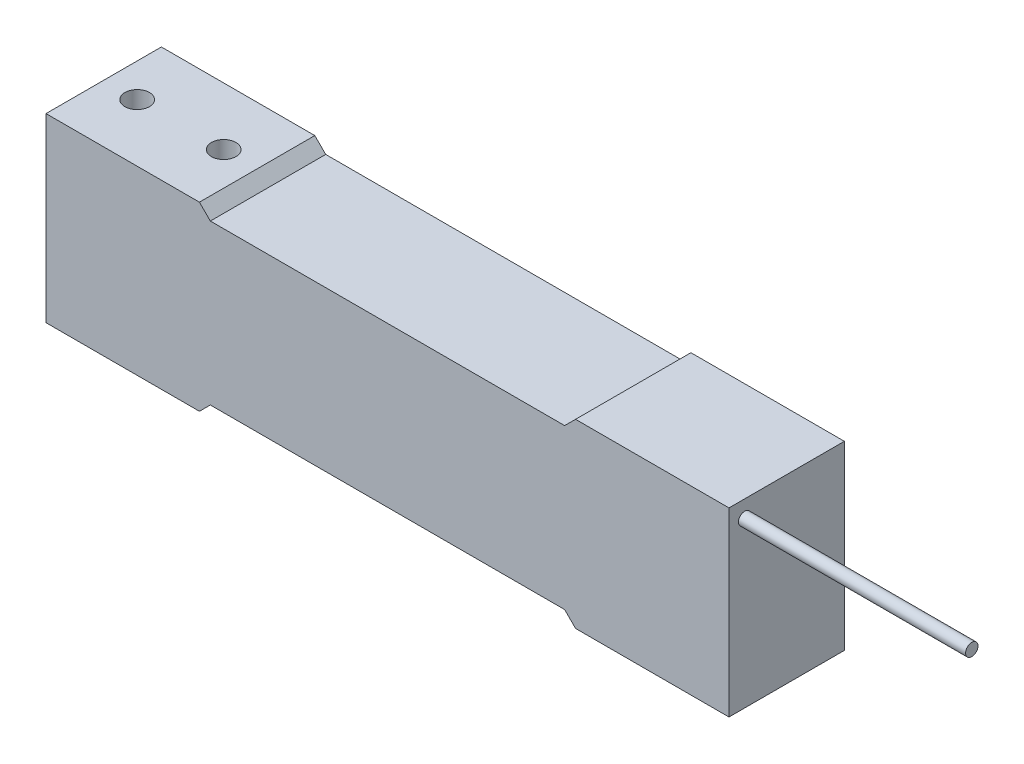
ISO-10303-21;
HEADER;
FILE_DESCRIPTION(('STEP AP214'),'2;1');
FILE_NAME('part.step','',(''),(''),'','','');
FILE_SCHEMA(('AUTOMOTIVE_DESIGN { 1 0 10303 214 1 1 1 1 }'));
ENDSEC;
DATA;
#1=APPLICATION_CONTEXT('core data for automotive mechanical design processes');
#2=APPLICATION_PROTOCOL_DEFINITION('international standard','automotive_design',2000,#1);
#3=PRODUCT_CONTEXT('',#1,'mechanical');
#4=PRODUCT('Part','Part','',(#3));
#5=PRODUCT_RELATED_PRODUCT_CATEGORY('part','',(#4));
#6=PRODUCT_DEFINITION_FORMATION('','',#4);
#7=PRODUCT_DEFINITION_CONTEXT('part definition',#1,'design');
#8=PRODUCT_DEFINITION('design','',#6,#7);
#9=PRODUCT_DEFINITION_SHAPE('','',#8);
#10=(LENGTH_UNIT() NAMED_UNIT(*) SI_UNIT(.MILLI.,.METRE.));
#11=(NAMED_UNIT(*) PLANE_ANGLE_UNIT() SI_UNIT($,.RADIAN.));
#12=(NAMED_UNIT(*) SI_UNIT($,.STERADIAN.) SOLID_ANGLE_UNIT());
#13=UNCERTAINTY_MEASURE_WITH_UNIT(LENGTH_MEASURE(1.E-05),#10,'distance_accuracy_value','');
#14=(GEOMETRIC_REPRESENTATION_CONTEXT(3) GLOBAL_UNCERTAINTY_ASSIGNED_CONTEXT((#13)) GLOBAL_UNIT_ASSIGNED_CONTEXT((#10,
#11,#12)) REPRESENTATION_CONTEXT('',''));
#15=CARTESIAN_POINT('',(0.,0.,0.));
#16=DIRECTION('',(0.,0.,1.));
#17=DIRECTION('',(1.,0.,0.));
#18=AXIS2_PLACEMENT_3D('',#15,#16,#17);
#19=CARTESIAN_POINT('',(75.184,19.939,-12.7));
#20=DIRECTION('',(-1.,0.,0.));
#21=DIRECTION('',(0.,0.,1.));
#22=AXIS2_PLACEMENT_3D('',#19,#20,#21);
#23=PLANE('',#22);
#24=DIRECTION('',(0.,0.,-1.));
#25=VECTOR('',#24,1.);
#26=CARTESIAN_POINT('',(75.184,-19.939,-12.7));
#27=LINE('',#26,#25);
#28=CARTESIAN_POINT('',(75.184,-19.939,12.7));
#29=VERTEX_POINT('',#28);
#30=CARTESIAN_POINT('',(75.184,-19.939,-12.7));
#31=VERTEX_POINT('',#30);
#32=EDGE_CURVE('E237',#29,#31,#27,.T.);
#33=ORIENTED_EDGE('',*,*,#32,.T.);
#34=DIRECTION('',(0.,-1.,0.));
#35=VECTOR('',#34,1.);
#36=CARTESIAN_POINT('',(75.184,19.939,-12.7));
#37=LINE('',#36,#35);
#38=CARTESIAN_POINT('',(75.184,19.939,-12.7));
#39=VERTEX_POINT('',#38);
#40=EDGE_CURVE('E41',#39,#31,#37,.T.);
#41=ORIENTED_EDGE('',*,*,#40,.F.);
#42=DIRECTION('',(0.,0.,-1.));
#43=VECTOR('',#42,1.);
#44=CARTESIAN_POINT('',(75.184,19.939,-12.7));
#45=LINE('',#44,#43);
#46=CARTESIAN_POINT('',(75.184,19.939,12.7));
#47=VERTEX_POINT('',#46);
#48=EDGE_CURVE('E246',#47,#39,#45,.T.);
#49=ORIENTED_EDGE('',*,*,#48,.F.);
#50=DIRECTION('',(0.,-1.,0.));
#51=VECTOR('',#50,1.);
#52=CARTESIAN_POINT('',(75.184,19.939,12.7));
#53=LINE('',#52,#51);
#54=EDGE_CURVE('E264',#47,#29,#53,.T.);
#55=ORIENTED_EDGE('',*,*,#54,.T.);
#56=EDGE_LOOP('',(#33,#41,#49,#55));
#57=FACE_BOUND('',#56,.T.);
#58=CARTESIAN_POINT('',(75.184,16.2079247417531,9.24452003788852));
#59=DIRECTION('',(-1.,0.,0.));
#60=DIRECTION('',(0.,0.,1.));
#61=AXIS2_PLACEMENT_3D('',#58,#59,#60);
#62=CIRCLE('',#61,1.36770933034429);
#63=CARTESIAN_POINT('',(75.184,16.2079247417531,10.6122293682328));
#64=VERTEX_POINT('',#63);
#65=EDGE_CURVE('E11',#64,#64,#62,.F.);
#66=ORIENTED_EDGE('',*,*,#65,.F.);
#67=EDGE_LOOP('',(#66));
#68=FACE_BOUND('',#67,.T.);
#69=ADVANCED_FACE('F33',(#57,#68),#23,.F.);
#70=CARTESIAN_POINT('',(-75.184,19.939,-12.7));
#71=DIRECTION('',(0.,0.,1.));
#72=DIRECTION('',(1.,0.,0.));
#73=AXIS2_PLACEMENT_3D('',#70,#71,#72);
#74=PLANE('',#73);
#75=DIRECTION('',(0.707106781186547,0.707106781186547,0.));
#76=VECTOR('',#75,1.);
#77=CARTESIAN_POINT('',(-41.402,-19.939,-12.7));
#78=LINE('',#77,#76);
#79=CARTESIAN_POINT('',(-41.402,-19.939,-12.7));
#80=VERTEX_POINT('',#79);
#81=CARTESIAN_POINT('',(-39.002,-17.539,-12.7));
#82=VERTEX_POINT('',#81);
#83=EDGE_CURVE('E163',#80,#82,#78,.T.);
#84=ORIENTED_EDGE('',*,*,#83,.F.);
#85=DIRECTION('',(-1.,0.,0.));
#86=VECTOR('',#85,1.);
#87=CARTESIAN_POINT('',(-75.184,-19.939,-12.7));
#88=LINE('',#87,#86);
#89=CARTESIAN_POINT('',(-75.184,-19.939,-12.7));
#90=VERTEX_POINT('',#89);
#91=EDGE_CURVE('E268',#80,#90,#88,.T.);
#92=ORIENTED_EDGE('',*,*,#91,.T.);
#93=DIRECTION('',(0.,-1.,0.));
#94=VECTOR('',#93,1.);
#95=CARTESIAN_POINT('',(-75.184,19.939,-12.7));
#96=LINE('',#95,#94);
#97=CARTESIAN_POINT('',(-75.184,19.939,-12.7));
#98=VERTEX_POINT('',#97);
#99=EDGE_CURVE('E287',#98,#90,#96,.T.);
#100=ORIENTED_EDGE('',*,*,#99,.F.);
#101=DIRECTION('',(-1.,0.,0.));
#102=VECTOR('',#101,1.);
#103=CARTESIAN_POINT('',(-75.184,19.939,-12.7));
#104=LINE('',#103,#102);
#105=CARTESIAN_POINT('',(-41.402,19.939,-12.7));
#106=VERTEX_POINT('',#105);
#107=EDGE_CURVE('E250',#106,#98,#104,.T.);
#108=ORIENTED_EDGE('',*,*,#107,.F.);
#109=DIRECTION('',(0.707106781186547,-0.707106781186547,0.));
#110=VECTOR('',#109,1.);
#111=CARTESIAN_POINT('',(-41.402,19.939,-12.7));
#112=LINE('',#111,#110);
#113=CARTESIAN_POINT('',(-39.002,17.539,-12.7));
#114=VERTEX_POINT('',#113);
#115=EDGE_CURVE('E212',#106,#114,#112,.T.);
#116=ORIENTED_EDGE('',*,*,#115,.T.);
#117=DIRECTION('',(1.,0.,0.));
#118=VECTOR('',#117,1.);
#119=CARTESIAN_POINT('',(-39.002,17.539,-12.7));
#120=LINE('',#119,#118);
#121=CARTESIAN_POINT('',(39.002,17.539,-12.7));
#122=VERTEX_POINT('',#121);
#123=EDGE_CURVE('E216',#114,#122,#120,.T.);
#124=ORIENTED_EDGE('',*,*,#123,.T.);
#125=DIRECTION('',(0.707106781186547,0.707106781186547,0.));
#126=VECTOR('',#125,1.);
#127=CARTESIAN_POINT('',(41.402,19.939,-12.7));
#128=LINE('',#127,#126);
#129=CARTESIAN_POINT('',(41.402,19.939,-12.7));
#130=VERTEX_POINT('',#129);
#131=EDGE_CURVE('E220',#122,#130,#128,.T.);
#132=ORIENTED_EDGE('',*,*,#131,.T.);
#133=EDGE_CURVE('E252',#39,#130,#104,.T.);
#134=ORIENTED_EDGE('',*,*,#133,.F.);
#135=ORIENTED_EDGE('',*,*,#40,.T.);
#136=CARTESIAN_POINT('',(41.402,-19.939,-12.7));
#137=VERTEX_POINT('',#136);
#138=EDGE_CURVE('E269',#31,#137,#88,.T.);
#139=ORIENTED_EDGE('',*,*,#138,.T.);
#140=DIRECTION('',(0.707106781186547,-0.707106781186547,0.));
#141=VECTOR('',#140,1.);
#142=CARTESIAN_POINT('',(41.402,-19.939,-12.7));
#143=LINE('',#142,#141);
#144=CARTESIAN_POINT('',(39.002,-17.539,-12.7));
#145=VERTEX_POINT('',#144);
#146=EDGE_CURVE('E48',#145,#137,#143,.T.);
#147=ORIENTED_EDGE('',*,*,#146,.F.);
#148=DIRECTION('',(1.,0.,0.));
#149=VECTOR('',#148,1.);
#150=CARTESIAN_POINT('',(-39.002,-17.539,-12.7));
#151=LINE('',#150,#149);
#152=EDGE_CURVE('E169',#82,#145,#151,.T.);
#153=ORIENTED_EDGE('',*,*,#152,.F.);
#154=EDGE_LOOP('',(#84,#92,#100,#108,#116,#124,#132,#134,#135,#139,#147,#153));
#155=FACE_BOUND('',#154,.T.);
#156=ADVANCED_FACE('F294',(#155),#74,.F.);
#157=CARTESIAN_POINT('',(-75.184,19.939,12.7));
#158=DIRECTION('',(0.,0.,-1.));
#159=DIRECTION('',(-1.,0.,0.));
#160=AXIS2_PLACEMENT_3D('',#157,#158,#159);
#161=PLANE('',#160);
#162=DIRECTION('',(0.707106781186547,0.707106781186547,0.));
#163=VECTOR('',#162,1.);
#164=CARTESIAN_POINT('',(-41.402,-19.939,12.7));
#165=LINE('',#164,#163);
#166=CARTESIAN_POINT('',(-41.402,-19.939,12.7));
#167=VERTEX_POINT('',#166);
#168=CARTESIAN_POINT('',(-39.002,-17.539,12.7));
#169=VERTEX_POINT('',#168);
#170=EDGE_CURVE('E162',#167,#169,#165,.T.);
#171=ORIENTED_EDGE('',*,*,#170,.T.);
#172=DIRECTION('',(1.,0.,0.));
#173=VECTOR('',#172,1.);
#174=CARTESIAN_POINT('',(-39.002,-17.539,12.7));
#175=LINE('',#174,#173);
#176=CARTESIAN_POINT('',(39.002,-17.539,12.7));
#177=VERTEX_POINT('',#176);
#178=EDGE_CURVE('E166',#169,#177,#175,.T.);
#179=ORIENTED_EDGE('',*,*,#178,.T.);
#180=DIRECTION('',(0.707106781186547,-0.707106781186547,0.));
#181=VECTOR('',#180,1.);
#182=CARTESIAN_POINT('',(41.402,-19.939,12.7));
#183=LINE('',#182,#181);
#184=CARTESIAN_POINT('',(41.402,-19.939,12.7));
#185=VERTEX_POINT('',#184);
#186=EDGE_CURVE('E176',#177,#185,#183,.T.);
#187=ORIENTED_EDGE('',*,*,#186,.T.);
#188=DIRECTION('',(1.,0.,0.));
#189=VECTOR('',#188,1.);
#190=CARTESIAN_POINT('',(-75.184,-19.939,12.7));
#191=LINE('',#190,#189);
#192=EDGE_CURVE('E276',#185,#29,#191,.T.);
#193=ORIENTED_EDGE('',*,*,#192,.T.);
#194=ORIENTED_EDGE('',*,*,#54,.F.);
#195=DIRECTION('',(1.,0.,0.));
#196=VECTOR('',#195,1.);
#197=CARTESIAN_POINT('',(-75.184,19.939,12.7));
#198=LINE('',#197,#196);
#199=CARTESIAN_POINT('',(41.402,19.939,12.7));
#200=VERTEX_POINT('',#199);
#201=EDGE_CURVE('E259',#200,#47,#198,.T.);
#202=ORIENTED_EDGE('',*,*,#201,.F.);
#203=DIRECTION('',(0.707106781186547,0.707106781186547,0.));
#204=VECTOR('',#203,1.);
#205=CARTESIAN_POINT('',(41.402,19.939,12.7));
#206=LINE('',#205,#204);
#207=CARTESIAN_POINT('',(39.002,17.539,12.7));
#208=VERTEX_POINT('',#207);
#209=EDGE_CURVE('E56',#208,#200,#206,.T.);
#210=ORIENTED_EDGE('',*,*,#209,.F.);
#211=DIRECTION('',(1.,0.,0.));
#212=VECTOR('',#211,1.);
#213=CARTESIAN_POINT('',(-39.002,17.539,12.7));
#214=LINE('',#213,#212);
#215=CARTESIAN_POINT('',(-39.002,17.539,12.7));
#216=VERTEX_POINT('',#215);
#217=EDGE_CURVE('E228',#216,#208,#214,.T.);
#218=ORIENTED_EDGE('',*,*,#217,.F.);
#219=DIRECTION('',(0.707106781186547,-0.707106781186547,0.));
#220=VECTOR('',#219,1.);
#221=CARTESIAN_POINT('',(-41.402,19.939,12.7));
#222=LINE('',#221,#220);
#223=CARTESIAN_POINT('',(-41.402,19.939,12.7));
#224=VERTEX_POINT('',#223);
#225=EDGE_CURVE('E211',#224,#216,#222,.T.);
#226=ORIENTED_EDGE('',*,*,#225,.F.);
#227=CARTESIAN_POINT('',(-75.184,19.939,12.7));
#228=VERTEX_POINT('',#227);
#229=EDGE_CURVE('E260',#228,#224,#198,.T.);
#230=ORIENTED_EDGE('',*,*,#229,.F.);
#231=DIRECTION('',(0.,-1.,0.));
#232=VECTOR('',#231,1.);
#233=CARTESIAN_POINT('',(-75.184,19.939,12.7));
#234=LINE('',#233,#232);
#235=CARTESIAN_POINT('',(-75.184,-19.939,12.7));
#236=VERTEX_POINT('',#235);
#237=EDGE_CURVE('E283',#228,#236,#234,.T.);
#238=ORIENTED_EDGE('',*,*,#237,.T.);
#239=EDGE_CURVE('E251',#236,#167,#191,.T.);
#240=ORIENTED_EDGE('',*,*,#239,.T.);
#241=EDGE_LOOP('',(#171,#179,#187,#193,#194,#202,#210,#218,#226,#230,#238,#240));
#242=FACE_BOUND('',#241,.T.);
#243=ADVANCED_FACE('F306',(#242),#161,.F.);
#244=CARTESIAN_POINT('',(75.184,-19.939,12.7));
#245=DIRECTION('',(0.,1.,0.));
#246=DIRECTION('',(0.,0.,1.));
#247=AXIS2_PLACEMENT_3D('',#244,#245,#246);
#248=PLANE('',#247);
#249=DIRECTION('',(0.,0.,1.));
#250=VECTOR('',#249,1.);
#251=CARTESIAN_POINT('',(-41.402,-19.939,-12.7));
#252=LINE('',#251,#250);
#253=EDGE_CURVE('E172',#80,#167,#252,.T.);
#254=ORIENTED_EDGE('',*,*,#253,.T.);
#255=ORIENTED_EDGE('',*,*,#239,.F.);
#256=DIRECTION('',(0.,0.,1.));
#257=VECTOR('',#256,1.);
#258=CARTESIAN_POINT('',(-75.184,-19.939,-12.7));
#259=LINE('',#258,#257);
#260=EDGE_CURVE('E273',#90,#236,#259,.T.);
#261=ORIENTED_EDGE('',*,*,#260,.F.);
#262=ORIENTED_EDGE('',*,*,#91,.F.);
#263=EDGE_LOOP('',(#254,#255,#261,#262));
#264=FACE_BOUND('',#263,.T.);
#265=ADVANCED_FACE('F317',(#264),#248,.F.);
#266=CARTESIAN_POINT('',(67.8180000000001,-19.939,0.));
#267=DIRECTION('',(0.,-1.,0.));
#268=DIRECTION('',(0.,0.,-1.));
#269=AXIS2_PLACEMENT_3D('',#266,#267,#268);
#270=CIRCLE('',#269,2.70509999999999);
#271=CARTESIAN_POINT('',(67.8180000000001,-19.939,-2.70509999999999));
#272=VERTEX_POINT('',#271);
#273=EDGE_CURVE('E145',#272,#272,#270,.T.);
#274=ORIENTED_EDGE('',*,*,#273,.F.);
#275=EDGE_LOOP('',(#274));
#276=FACE_BOUND('',#275,.T.);
#277=CARTESIAN_POINT('',(48.768,-19.939,0.));
#278=DIRECTION('',(0.,-1.,0.));
#279=DIRECTION('',(0.,0.,-1.));
#280=AXIS2_PLACEMENT_3D('',#277,#278,#279);
#281=CIRCLE('',#280,2.70509999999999);
#282=CARTESIAN_POINT('',(48.768,-19.939,-2.70509999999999));
#283=VERTEX_POINT('',#282);
#284=EDGE_CURVE('E144',#283,#283,#281,.T.);
#285=ORIENTED_EDGE('',*,*,#284,.F.);
#286=EDGE_LOOP('',(#285));
#287=FACE_BOUND('',#286,.T.);
#288=DIRECTION('',(0.,0.,1.));
#289=VECTOR('',#288,1.);
#290=CARTESIAN_POINT('',(41.402,-19.939,-12.7));
#291=LINE('',#290,#289);
#292=EDGE_CURVE('E190',#137,#185,#291,.T.);
#293=ORIENTED_EDGE('',*,*,#292,.F.);
#294=ORIENTED_EDGE('',*,*,#138,.F.);
#295=ORIENTED_EDGE('',*,*,#32,.F.);
#296=ORIENTED_EDGE('',*,*,#192,.F.);
#297=EDGE_LOOP('',(#293,#294,#295,#296));
#298=FACE_BOUND('',#297,.T.);
#299=ADVANCED_FACE('F302',(#276,#287,#298),#248,.F.);
#300=CARTESIAN_POINT('',(75.184,19.939,12.7));
#301=DIRECTION('',(0.,1.,0.));
#302=DIRECTION('',(0.,0.,1.));
#303=AXIS2_PLACEMENT_3D('',#300,#301,#302);
#304=PLANE('',#303);
#305=CARTESIAN_POINT('',(-48.768,19.939,0.));
#306=DIRECTION('',(0.,1.,0.));
#307=DIRECTION('',(0.,0.,1.));
#308=AXIS2_PLACEMENT_3D('',#305,#306,#307);
#309=CIRCLE('',#308,2.70509999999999);
#310=CARTESIAN_POINT('',(-48.768,19.939,2.70509999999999));
#311=VERTEX_POINT('',#310);
#312=EDGE_CURVE('E186',#311,#311,#309,.T.);
#313=ORIENTED_EDGE('',*,*,#312,.F.);
#314=EDGE_LOOP('',(#313));
#315=FACE_BOUND('',#314,.T.);
#316=CARTESIAN_POINT('',(-67.818,19.939,0.));
#317=DIRECTION('',(0.,1.,0.));
#318=DIRECTION('',(0.,0.,1.));
#319=AXIS2_PLACEMENT_3D('',#316,#317,#318);
#320=CIRCLE('',#319,2.70509999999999);
#321=CARTESIAN_POINT('',(-67.818,19.939,2.70509999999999));
#322=VERTEX_POINT('',#321);
#323=EDGE_CURVE('E203',#322,#322,#320,.T.);
#324=ORIENTED_EDGE('',*,*,#323,.F.);
#325=EDGE_LOOP('',(#324));
#326=FACE_BOUND('',#325,.T.);
#327=DIRECTION('',(0.,0.,1.));
#328=VECTOR('',#327,1.);
#329=CARTESIAN_POINT('',(-41.402,19.939,-12.7));
#330=LINE('',#329,#328);
#331=EDGE_CURVE('E234',#106,#224,#330,.T.);
#332=ORIENTED_EDGE('',*,*,#331,.F.);
#333=ORIENTED_EDGE('',*,*,#107,.T.);
#334=DIRECTION('',(0.,0.,1.));
#335=VECTOR('',#334,1.);
#336=CARTESIAN_POINT('',(-75.184,19.939,-12.7));
#337=LINE('',#336,#335);
#338=EDGE_CURVE('E256',#98,#228,#337,.T.);
#339=ORIENTED_EDGE('',*,*,#338,.T.);
#340=ORIENTED_EDGE('',*,*,#229,.T.);
#341=EDGE_LOOP('',(#332,#333,#339,#340));
#342=FACE_BOUND('',#341,.T.);
#343=ADVANCED_FACE('F339',(#315,#326,#342),#304,.T.);
#344=CARTESIAN_POINT('',(-75.184,19.939,-12.7));
#345=DIRECTION('',(1.,0.,0.));
#346=DIRECTION('',(0.,0.,-1.));
#347=AXIS2_PLACEMENT_3D('',#344,#345,#346);
#348=PLANE('',#347);
#349=ORIENTED_EDGE('',*,*,#260,.T.);
#350=ORIENTED_EDGE('',*,*,#237,.F.);
#351=ORIENTED_EDGE('',*,*,#338,.F.);
#352=ORIENTED_EDGE('',*,*,#99,.T.);
#353=EDGE_LOOP('',(#349,#350,#351,#352));
#354=FACE_BOUND('',#353,.T.);
#355=ADVANCED_FACE('F344',(#354),#348,.F.);
#356=DIRECTION('',(0.,0.,1.));
#357=VECTOR('',#356,1.);
#358=CARTESIAN_POINT('',(41.402,19.939,-12.7));
#359=LINE('',#358,#357);
#360=EDGE_CURVE('E238',#130,#200,#359,.T.);
#361=ORIENTED_EDGE('',*,*,#360,.T.);
#362=ORIENTED_EDGE('',*,*,#201,.T.);
#363=ORIENTED_EDGE('',*,*,#48,.T.);
#364=ORIENTED_EDGE('',*,*,#133,.T.);
#365=EDGE_LOOP('',(#361,#362,#363,#364));
#366=FACE_BOUND('',#365,.T.);
#367=ADVANCED_FACE('F326',(#366),#304,.T.);
#368=CARTESIAN_POINT('',(-41.402,19.939,-12.7));
#369=DIRECTION('',(-0.707106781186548,-0.707106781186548,0.));
#370=DIRECTION('',(0.707106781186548,-0.707106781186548,0.));
#371=AXIS2_PLACEMENT_3D('',#368,#369,#370);
#372=PLANE('',#371);
#373=ORIENTED_EDGE('',*,*,#225,.T.);
#374=DIRECTION('',(0.,0.,1.));
#375=VECTOR('',#374,1.);
#376=CARTESIAN_POINT('',(-39.002,17.539,-12.7));
#377=LINE('',#376,#375);
#378=EDGE_CURVE('E224',#114,#216,#377,.T.);
#379=ORIENTED_EDGE('',*,*,#378,.F.);
#380=ORIENTED_EDGE('',*,*,#115,.F.);
#381=ORIENTED_EDGE('',*,*,#331,.T.);
#382=EDGE_LOOP('',(#373,#379,#380,#381));
#383=FACE_BOUND('',#382,.T.);
#384=ADVANCED_FACE('F335',(#383),#372,.F.);
#385=CARTESIAN_POINT('',(41.402,19.939,-12.7));
#386=DIRECTION('',(0.707106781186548,-0.707106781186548,0.));
#387=DIRECTION('',(0.707106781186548,0.707106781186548,0.));
#388=AXIS2_PLACEMENT_3D('',#385,#386,#387);
#389=PLANE('',#388);
#390=ORIENTED_EDGE('',*,*,#209,.T.);
#391=ORIENTED_EDGE('',*,*,#360,.F.);
#392=ORIENTED_EDGE('',*,*,#131,.F.);
#393=DIRECTION('',(0.,0.,1.));
#394=VECTOR('',#393,1.);
#395=CARTESIAN_POINT('',(39.002,17.539,-12.7));
#396=LINE('',#395,#394);
#397=EDGE_CURVE('E241',#122,#208,#396,.T.);
#398=ORIENTED_EDGE('',*,*,#397,.T.);
#399=EDGE_LOOP('',(#390,#391,#392,#398));
#400=FACE_BOUND('',#399,.T.);
#401=ADVANCED_FACE('F368',(#400),#389,.F.);
#402=CARTESIAN_POINT('',(-39.002,17.539,-12.7));
#403=DIRECTION('',(0.,-1.,0.));
#404=DIRECTION('',(0.,0.,-1.));
#405=AXIS2_PLACEMENT_3D('',#402,#403,#404);
#406=PLANE('',#405);
#407=ORIENTED_EDGE('',*,*,#217,.T.);
#408=ORIENTED_EDGE('',*,*,#397,.F.);
#409=ORIENTED_EDGE('',*,*,#123,.F.);
#410=ORIENTED_EDGE('',*,*,#378,.T.);
#411=EDGE_LOOP('',(#407,#408,#409,#410));
#412=FACE_BOUND('',#411,.T.);
#413=ADVANCED_FACE('F331',(#412),#406,.F.);
#414=CARTESIAN_POINT('',(-67.818,8.763,0.));
#415=DIRECTION('',(0.,1.,0.));
#416=DIRECTION('',(0.,0.,1.));
#417=AXIS2_PLACEMENT_3D('',#414,#415,#416);
#418=CONICAL_SURFACE('',#417,2.7051,1.02974425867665);
#419=CARTESIAN_POINT('',(-67.818,7.13761193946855,0.));
#420=VERTEX_POINT('',#419);
#421=VERTEX_LOOP('',#420);
#422=FACE_BOUND('',#421,.T.);
#423=CARTESIAN_POINT('',(-67.818,8.763,0.));
#424=DIRECTION('',(0.,1.,0.));
#425=DIRECTION('',(0.,0.,1.));
#426=AXIS2_PLACEMENT_3D('',#423,#424,#425);
#427=CIRCLE('',#426,2.7051);
#428=CARTESIAN_POINT('',(-67.818,8.763,2.7051));
#429=VERTEX_POINT('',#428);
#430=EDGE_CURVE('E207',#429,#429,#427,.T.);
#431=ORIENTED_EDGE('',*,*,#430,.T.);
#432=EDGE_LOOP('',(#431));
#433=FACE_BOUND('',#432,.T.);
#434=ADVANCED_FACE('F371',(#422,#433),#418,.F.);
#435=CARTESIAN_POINT('',(-67.818,19.939,0.));
#436=DIRECTION('',(0.,1.,0.));
#437=DIRECTION('',(0.,0.,1.));
#438=AXIS2_PLACEMENT_3D('',#435,#436,#437);
#439=CYLINDRICAL_SURFACE('',#438,2.70509999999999);
#440=ORIENTED_EDGE('',*,*,#430,.F.);
#441=EDGE_LOOP('',(#440));
#442=FACE_BOUND('',#441,.T.);
#443=ORIENTED_EDGE('',*,*,#323,.T.);
#444=EDGE_LOOP('',(#443));
#445=FACE_BOUND('',#444,.T.);
#446=ADVANCED_FACE('F376',(#442,#445),#439,.F.);
#447=CARTESIAN_POINT('',(-48.768,8.763,0.));
#448=DIRECTION('',(0.,1.,0.));
#449=DIRECTION('',(0.,0.,1.));
#450=AXIS2_PLACEMENT_3D('',#447,#448,#449);
#451=CONICAL_SURFACE('',#450,2.70509999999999,1.02974425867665);
#452=CARTESIAN_POINT('',(-48.768,7.13761193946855,0.));
#453=VERTEX_POINT('',#452);
#454=VERTEX_LOOP('',#453);
#455=FACE_BOUND('',#454,.T.);
#456=CARTESIAN_POINT('',(-48.768,8.763,0.));
#457=DIRECTION('',(0.,1.,0.));
#458=DIRECTION('',(0.,0.,1.));
#459=AXIS2_PLACEMENT_3D('',#456,#457,#458);
#460=CIRCLE('',#459,2.70509999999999);
#461=CARTESIAN_POINT('',(-48.768,8.763,2.70509999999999));
#462=VERTEX_POINT('',#461);
#463=EDGE_CURVE('E199',#462,#462,#460,.T.);
#464=ORIENTED_EDGE('',*,*,#463,.T.);
#465=EDGE_LOOP('',(#464));
#466=FACE_BOUND('',#465,.T.);
#467=ADVANCED_FACE('F380',(#455,#466),#451,.F.);
#468=CARTESIAN_POINT('',(-48.768,19.939,0.));
#469=DIRECTION('',(0.,1.,0.));
#470=DIRECTION('',(0.,0.,1.));
#471=AXIS2_PLACEMENT_3D('',#468,#469,#470);
#472=CYLINDRICAL_SURFACE('',#471,2.70509999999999);
#473=ORIENTED_EDGE('',*,*,#463,.F.);
#474=EDGE_LOOP('',(#473));
#475=FACE_BOUND('',#474,.T.);
#476=ORIENTED_EDGE('',*,*,#312,.T.);
#477=EDGE_LOOP('',(#476));
#478=FACE_BOUND('',#477,.T.);
#479=ADVANCED_FACE('F384',(#475,#478),#472,.F.);
#480=CARTESIAN_POINT('',(-41.402,-19.939,-12.7));
#481=DIRECTION('',(0.707106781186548,-0.707106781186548,0.));
#482=DIRECTION('',(0.707106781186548,0.707106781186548,0.));
#483=AXIS2_PLACEMENT_3D('',#480,#481,#482);
#484=PLANE('',#483);
#485=ORIENTED_EDGE('',*,*,#170,.F.);
#486=ORIENTED_EDGE('',*,*,#253,.F.);
#487=ORIENTED_EDGE('',*,*,#83,.T.);
#488=DIRECTION('',(0.,0.,1.));
#489=VECTOR('',#488,1.);
#490=CARTESIAN_POINT('',(-39.002,-17.539,-12.7));
#491=LINE('',#490,#489);
#492=EDGE_CURVE('E182',#82,#169,#491,.T.);
#493=ORIENTED_EDGE('',*,*,#492,.T.);
#494=EDGE_LOOP('',(#485,#486,#487,#493));
#495=FACE_BOUND('',#494,.T.);
#496=ADVANCED_FACE('F312',(#495),#484,.T.);
#497=CARTESIAN_POINT('',(-39.002,-17.539,-12.7));
#498=DIRECTION('',(0.,-1.,0.));
#499=DIRECTION('',(0.,0.,-1.));
#500=AXIS2_PLACEMENT_3D('',#497,#498,#499);
#501=PLANE('',#500);
#502=ORIENTED_EDGE('',*,*,#178,.F.);
#503=ORIENTED_EDGE('',*,*,#492,.F.);
#504=ORIENTED_EDGE('',*,*,#152,.T.);
#505=DIRECTION('',(0.,0.,1.));
#506=VECTOR('',#505,1.);
#507=CARTESIAN_POINT('',(39.002,-17.539,-12.7));
#508=LINE('',#507,#506);
#509=EDGE_CURVE('E187',#145,#177,#508,.T.);
#510=ORIENTED_EDGE('',*,*,#509,.T.);
#511=EDGE_LOOP('',(#502,#503,#504,#510));
#512=FACE_BOUND('',#511,.T.);
#513=ADVANCED_FACE('F309',(#512),#501,.T.);
#514=CARTESIAN_POINT('',(41.402,-19.939,-12.7));
#515=DIRECTION('',(-0.707106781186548,-0.707106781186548,0.));
#516=DIRECTION('',(0.707106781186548,-0.707106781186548,0.));
#517=AXIS2_PLACEMENT_3D('',#514,#515,#516);
#518=PLANE('',#517);
#519=ORIENTED_EDGE('',*,*,#186,.F.);
#520=ORIENTED_EDGE('',*,*,#509,.F.);
#521=ORIENTED_EDGE('',*,*,#146,.T.);
#522=ORIENTED_EDGE('',*,*,#292,.T.);
#523=EDGE_LOOP('',(#519,#520,#521,#522));
#524=FACE_BOUND('',#523,.T.);
#525=ADVANCED_FACE('F304',(#524),#518,.T.);
#526=CARTESIAN_POINT('',(48.768,-8.763,0.));
#527=DIRECTION('',(0.,-1.,0.));
#528=DIRECTION('',(0.,0.,-1.));
#529=AXIS2_PLACEMENT_3D('',#526,#527,#528);
#530=CONICAL_SURFACE('',#529,2.70509999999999,1.02974425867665);
#531=CARTESIAN_POINT('',(48.768,-7.13761193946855,0.));
#532=VERTEX_POINT('',#531);
#533=VERTEX_LOOP('',#532);
#534=FACE_BOUND('',#533,.T.);
#535=CARTESIAN_POINT('',(48.768,-8.763,0.));
#536=DIRECTION('',(0.,-1.,0.));
#537=DIRECTION('',(0.,0.,-1.));
#538=AXIS2_PLACEMENT_3D('',#535,#536,#537);
#539=CIRCLE('',#538,2.70509999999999);
#540=CARTESIAN_POINT('',(48.768,-8.763,-2.70509999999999));
#541=VERTEX_POINT('',#540);
#542=EDGE_CURVE('E151',#541,#541,#539,.T.);
#543=ORIENTED_EDGE('',*,*,#542,.T.);
#544=EDGE_LOOP('',(#543));
#545=FACE_BOUND('',#544,.T.);
#546=ADVANCED_FACE('F393',(#534,#545),#530,.F.);
#547=CARTESIAN_POINT('',(48.768,-19.939,0.));
#548=DIRECTION('',(0.,-1.,0.));
#549=DIRECTION('',(0.,0.,-1.));
#550=AXIS2_PLACEMENT_3D('',#547,#548,#549);
#551=CYLINDRICAL_SURFACE('',#550,2.70509999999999);
#552=ORIENTED_EDGE('',*,*,#542,.F.);
#553=EDGE_LOOP('',(#552));
#554=FACE_BOUND('',#553,.T.);
#555=ORIENTED_EDGE('',*,*,#284,.T.);
#556=EDGE_LOOP('',(#555));
#557=FACE_BOUND('',#556,.T.);
#558=ADVANCED_FACE('F137',(#554,#557),#551,.F.);
#559=CARTESIAN_POINT('',(67.8180000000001,-8.763,0.));
#560=DIRECTION('',(0.,-1.,0.));
#561=DIRECTION('',(0.,0.,-1.));
#562=AXIS2_PLACEMENT_3D('',#559,#560,#561);
#563=CONICAL_SURFACE('',#562,2.7051,1.02974425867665);
#564=CARTESIAN_POINT('',(67.8180000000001,-7.13761193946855,0.));
#565=VERTEX_POINT('',#564);
#566=VERTEX_LOOP('',#565);
#567=FACE_BOUND('',#566,.T.);
#568=CARTESIAN_POINT('',(67.8180000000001,-8.763,0.));
#569=DIRECTION('',(0.,-1.,0.));
#570=DIRECTION('',(0.,0.,-1.));
#571=AXIS2_PLACEMENT_3D('',#568,#569,#570);
#572=CIRCLE('',#571,2.7051);
#573=CARTESIAN_POINT('',(67.8180000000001,-8.763,-2.7051));
#574=VERTEX_POINT('',#573);
#575=EDGE_CURVE('E141',#574,#574,#572,.T.);
#576=ORIENTED_EDGE('',*,*,#575,.T.);
#577=EDGE_LOOP('',(#576));
#578=FACE_BOUND('',#577,.T.);
#579=ADVANCED_FACE('F133',(#567,#578),#563,.F.);
#580=CARTESIAN_POINT('',(67.8180000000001,-19.939,0.));
#581=DIRECTION('',(0.,-1.,0.));
#582=DIRECTION('',(0.,0.,-1.));
#583=AXIS2_PLACEMENT_3D('',#580,#581,#582);
#584=CYLINDRICAL_SURFACE('',#583,2.70509999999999);
#585=ORIENTED_EDGE('',*,*,#575,.F.);
#586=EDGE_LOOP('',(#585));
#587=FACE_BOUND('',#586,.T.);
#588=ORIENTED_EDGE('',*,*,#273,.T.);
#589=EDGE_LOOP('',(#588));
#590=FACE_BOUND('',#589,.T.);
#591=ADVANCED_FACE('F136',(#587,#590),#584,.F.);
#592=CARTESIAN_POINT('',(125.184,16.2079247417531,9.24452003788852));
#593=DIRECTION('',(-1.,0.,0.));
#594=DIRECTION('',(0.,0.,1.));
#595=AXIS2_PLACEMENT_3D('',#592,#593,#594);
#596=CYLINDRICAL_SURFACE('',#595,1.36770933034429);
#597=CARTESIAN_POINT('',(125.184,16.2079247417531,9.24452003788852));
#598=DIRECTION('',(1.,0.,0.));
#599=DIRECTION('',(0.,0.,-1.));
#600=AXIS2_PLACEMENT_3D('',#597,#598,#599);
#601=CIRCLE('',#600,1.36770933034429);
#602=CARTESIAN_POINT('',(125.184,16.2079247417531,7.87681070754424));
#603=VERTEX_POINT('',#602);
#604=EDGE_CURVE('E155',#603,#603,#601,.T.);
#605=ORIENTED_EDGE('',*,*,#604,.F.);
#606=EDGE_LOOP('',(#605));
#607=FACE_BOUND('',#606,.T.);
#608=ORIENTED_EDGE('',*,*,#65,.T.);
#609=EDGE_LOOP('',(#608));
#610=FACE_BOUND('',#609,.T.);
#611=ADVANCED_FACE('F404',(#607,#610),#596,.T.);
#612=CARTESIAN_POINT('',(125.184,16.2079247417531,9.24452003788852));
#613=DIRECTION('',(1.,0.,0.));
#614=DIRECTION('',(0.,0.,-1.));
#615=AXIS2_PLACEMENT_3D('',#612,#613,#614);
#616=PLANE('',#615);
#617=ORIENTED_EDGE('',*,*,#604,.T.);
#618=EDGE_LOOP('',(#617));
#619=FACE_BOUND('',#618,.T.);
#620=ADVANCED_FACE('F407',(#619),#616,.T.);
#621=CLOSED_SHELL('',(#69,#156,#243,#265,#299,#343,#355,#367,#384,#401,#413,#434,#446,#467,#479,
#496,#513,#525,#546,#558,#579,#591,#611,#620));
#622=MANIFOLD_SOLID_BREP('B2',#621);
#623=ADVANCED_BREP_SHAPE_REPRESENTATION('',(#18,#622),#14);
#624=SHAPE_DEFINITION_REPRESENTATION(#9,#623);
ENDSEC;
END-ISO-10303-21;
